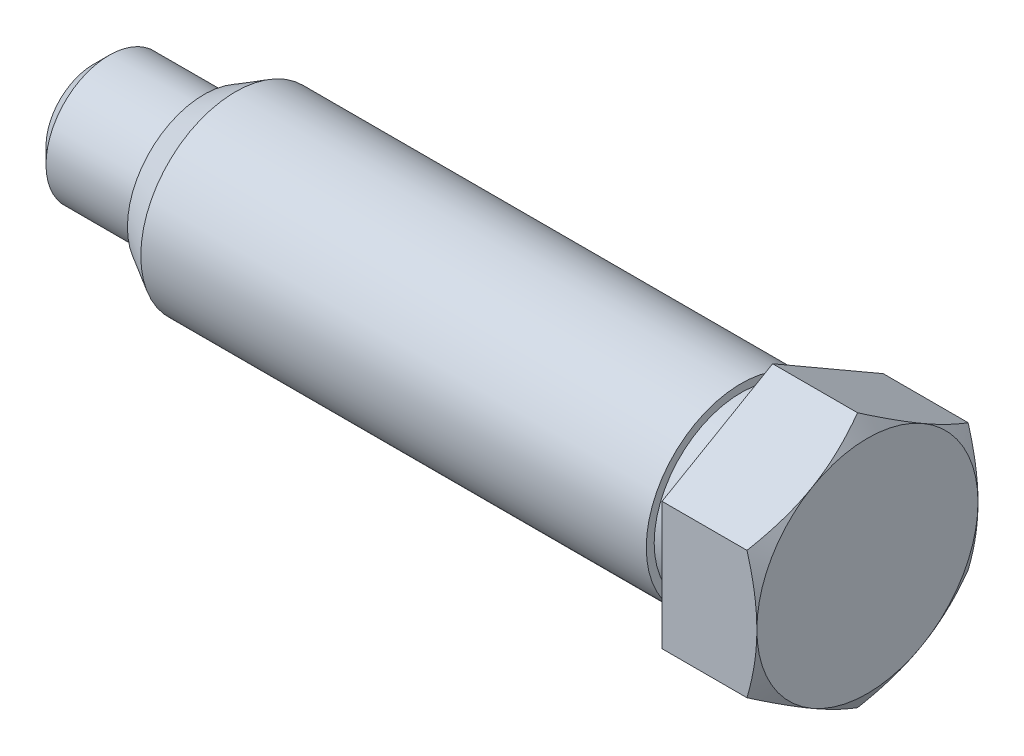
from build123d import *

# Parameters (mm, degrees)
CHANFREIN1_SIZE              = 1
ESQUISSE2_OUTSIDE_W          = 31.044
ESQUISSE2_OUTSIDE_H          = 31.044
ESQUISSE2_OUTSIDE_W_2        = 14
ESQUISSE2_OUTSIDE_H_2        = 20
ENL_V_MAT_EXTRU_1_DEPTH      = 51.626080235
R_P_TITION_CIRCULAIRE2_COUNT = 3
R_P_TITION_CIRCULAIRE2_ANGLE = 120


with BuildPart() as part:
    # Esquisse1 → Base-R_volution (revolve)
    with BuildSketch(Plane.XY, mode=Mode.PRIVATE) as base_r_volution_sk:
        Polygon((-80, 0), (-80, 4), (-73, 4), (-73, 4.845299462), (-71, 6), (-39, 6), (-39, 5.5), (-37, 5.5), (-37, 9), (-32.154700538, 9), (-31, 7), (-31, 0), align=None)
    revolve(base_r_volution_sk.sketch.rotate(Axis((-100, 0, 0), (1, 0, 0)), 90), axis=Axis((-100, 0, 0), (1, 0, 0)))

    # Chanfrein1
    chanfrein1_edges = [part.edges().sort_by_distance(p)[0] for p in [
        (-80, 0, -4),
    ]]
    chamfer(chanfrein1_edges, length=CHANFREIN1_SIZE)

    # Esquisse2 outside → Enl_v. mat.-Extru.1 (cut, through all)
    with BuildSketch(Plane(origin=(-31, 0, 0), x_dir=(0, 0, -1), z_dir=(1, 0, 0))):
        Rectangle(ESQUISSE2_OUTSIDE_W, ESQUISSE2_OUTSIDE_H)
        Rectangle(ESQUISSE2_OUTSIDE_W_2, ESQUISSE2_OUTSIDE_H_2, mode=Mode.SUBTRACT)
    enl_v_mat_extru_1 = extrude(amount=-ENL_V_MAT_EXTRU_1_DEPTH, mode=Mode.SUBTRACT)

    # R_p_tition circulaire2: Enl_v. mat.-Extru.1 ×3 about axis
    r_p_tition_circulaire2_axis = Axis((0, 0, 0), (1, 0, 0))
    for i in range(1, R_P_TITION_CIRCULAIRE2_COUNT):
        add(enl_v_mat_extru_1.rotate(r_p_tition_circulaire2_axis, i * R_P_TITION_CIRCULAIRE2_ANGLE / (R_P_TITION_CIRCULAIRE2_COUNT - 1)), mode=Mode.SUBTRACT)


solid = part.part
